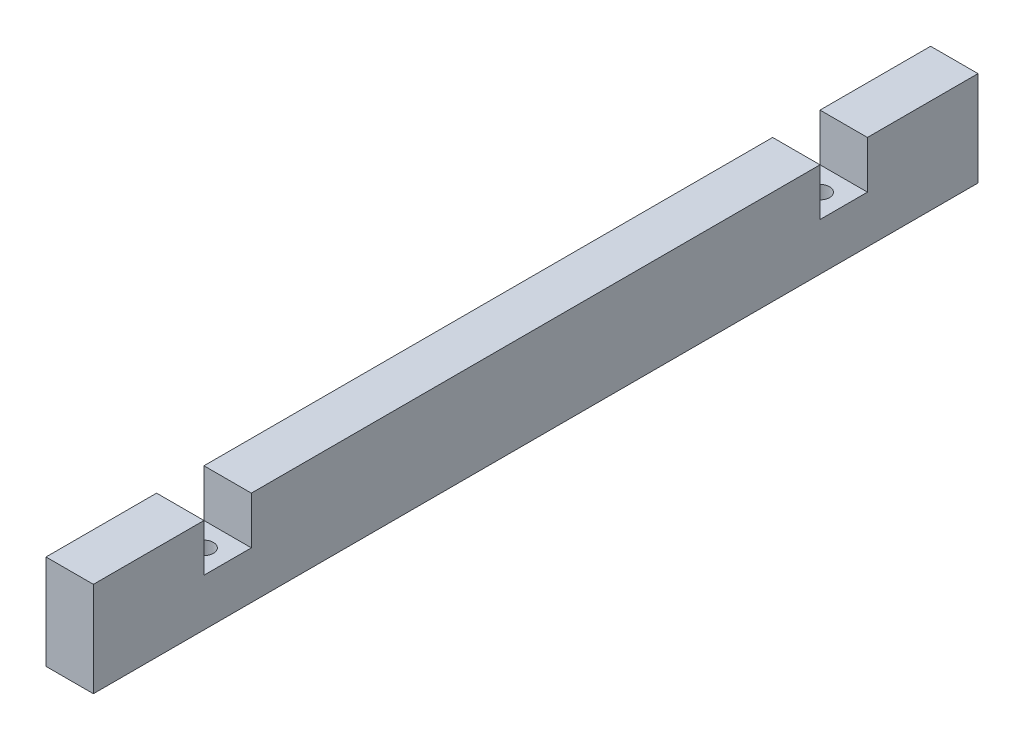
from build123d import *

# Parameters (mm, degrees)
ESQUISSE1_W             = 15
ESQUISSE1_H             = 30
BOSS_EXTRU_1_DEPTH      = 140
ESQUISSE2_W             = 15
ESQUISSE2_H             = 15
ENL_V_MAT_EXTRU_1_DEPTH = 144.961800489
ESQUISSE3_R             = 3
ENL_V_MAT_EXTRU_2_DEPTH = 142.598022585


with BuildPart() as part:
    # Esquisse1 → Boss.-Extru.1 (new, symmetric)
    with BuildSketch(Plane.XY):
        with Locations((-7.5, 15)):
            Rectangle(ESQUISSE1_W, ESQUISSE1_H)
    extrude(amount=BOSS_EXTRU_1_DEPTH, both=True)

    # Esquisse2 → Enl_v. mat.-Extru.1 (cut, through all)
    with BuildSketch(Plane(origin=(0, 0, 0), x_dir=(0, 0, -1), z_dir=(1, 0, 0))):
        with Locations((97.5, 22.5)):
            Rectangle(ESQUISSE2_W, ESQUISSE2_H)
    enl_v_mat_extru_1 = extrude(amount=-ENL_V_MAT_EXTRU_1_DEPTH, mode=Mode.SUBTRACT)

    # Esquisse3 → Enl_v. mat.-Extru.2 (cut, through all)
    with BuildSketch(Plane(origin=(0, 15, 0), x_dir=(1, 0, 0), z_dir=(0, 1, 0))):
        with Locations(Location((-7.5, 97.5, 0), (0, 0, 270))):
            Circle(ESQUISSE3_R)
    enl_v_mat_extru_2 = extrude(amount=-ENL_V_MAT_EXTRU_2_DEPTH, mode=Mode.SUBTRACT)

    # Sym_trie1: Enl_v. mat.-Extru.1, Enl_v. mat.-Extru.2 across plane
    add(enl_v_mat_extru_1.mirror(Plane.XY), mode=Mode.SUBTRACT)
    add(enl_v_mat_extru_2.mirror(Plane.XY), mode=Mode.SUBTRACT)


solid = part.part
